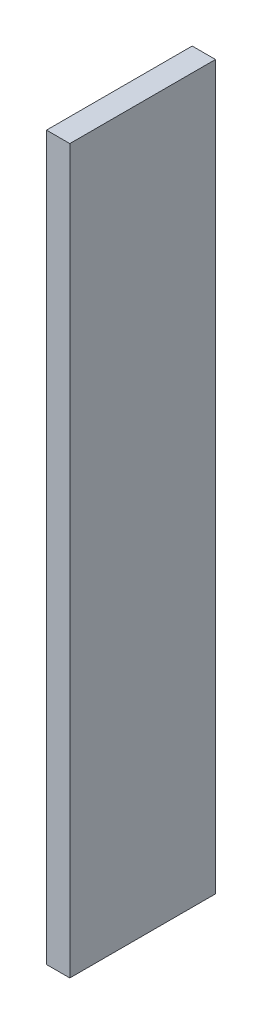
ISO-10303-21;
HEADER;
FILE_DESCRIPTION(('STEP AP214'),'2;1');
FILE_NAME('part.step','',(''),(''),'','','');
FILE_SCHEMA(('AUTOMOTIVE_DESIGN { 1 0 10303 214 1 1 1 1 }'));
ENDSEC;
DATA;
#1=APPLICATION_CONTEXT('core data for automotive mechanical design processes');
#2=APPLICATION_PROTOCOL_DEFINITION('international standard','automotive_design',2000,#1);
#3=PRODUCT_CONTEXT('',#1,'mechanical');
#4=PRODUCT('Part','Part','',(#3));
#5=PRODUCT_RELATED_PRODUCT_CATEGORY('part','',(#4));
#6=PRODUCT_DEFINITION_FORMATION('','',#4);
#7=PRODUCT_DEFINITION_CONTEXT('part definition',#1,'design');
#8=PRODUCT_DEFINITION('design','',#6,#7);
#9=PRODUCT_DEFINITION_SHAPE('','',#8);
#10=(LENGTH_UNIT() NAMED_UNIT(*) SI_UNIT(.MILLI.,.METRE.));
#11=(NAMED_UNIT(*) PLANE_ANGLE_UNIT() SI_UNIT($,.RADIAN.));
#12=(NAMED_UNIT(*) SI_UNIT($,.STERADIAN.) SOLID_ANGLE_UNIT());
#13=UNCERTAINTY_MEASURE_WITH_UNIT(LENGTH_MEASURE(1.E-05),#10,'distance_accuracy_value','');
#14=(GEOMETRIC_REPRESENTATION_CONTEXT(3) GLOBAL_UNCERTAINTY_ASSIGNED_CONTEXT((#13)) GLOBAL_UNIT_ASSIGNED_CONTEXT((#10,
#11,#12)) REPRESENTATION_CONTEXT('',''));
#15=CARTESIAN_POINT('',(0.,0.,0.));
#16=DIRECTION('',(0.,0.,1.));
#17=DIRECTION('',(1.,0.,0.));
#18=AXIS2_PLACEMENT_3D('',#15,#16,#17);
#19=CARTESIAN_POINT('',(0.,62.,25.));
#20=DIRECTION('',(1.,0.,0.));
#21=DIRECTION('',(0.,0.,-1.));
#22=AXIS2_PLACEMENT_3D('',#19,#20,#21);
#23=PLANE('',#22);
#24=DIRECTION('',(0.,0.,-1.));
#25=VECTOR('',#24,1.);
#26=CARTESIAN_POINT('',(1.66533453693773E-13,-62.,0.));
#27=LINE('',#26,#25);
#28=CARTESIAN_POINT('',(3.05311331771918E-13,-62.,25.));
#29=VERTEX_POINT('',#28);
#30=CARTESIAN_POINT('',(1.66533453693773E-13,-62.,0.));
#31=VERTEX_POINT('',#30);
#32=EDGE_CURVE('E11',#29,#31,#27,.T.);
#33=ORIENTED_EDGE('',*,*,#32,.F.);
#34=DIRECTION('',(0.,-1.,0.));
#35=VECTOR('',#34,1.);
#36=CARTESIAN_POINT('',(0.,62.,25.));
#37=LINE('',#36,#35);
#38=CARTESIAN_POINT('',(0.,62.,25.));
#39=VERTEX_POINT('',#38);
#40=EDGE_CURVE('E82',#29,#39,#37,.F.);
#41=ORIENTED_EDGE('',*,*,#40,.T.);
#42=DIRECTION('',(0.,0.,-1.));
#43=VECTOR('',#42,1.);
#44=CARTESIAN_POINT('',(-1.59594559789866E-13,62.,0.));
#45=LINE('',#44,#43);
#46=CARTESIAN_POINT('',(-1.59594559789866E-13,62.,0.));
#47=VERTEX_POINT('',#46);
#48=EDGE_CURVE('E83',#39,#47,#45,.T.);
#49=ORIENTED_EDGE('',*,*,#48,.T.);
#50=DIRECTION('',(0.,1.,0.));
#51=VECTOR('',#50,1.);
#52=CARTESIAN_POINT('',(1.66533453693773E-13,-62.2828427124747,0.));
#53=LINE('',#52,#51);
#54=CARTESIAN_POINT('',(-1.11022302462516E-13,48.,0.));
#55=VERTEX_POINT('',#54);
#56=EDGE_CURVE('E102',#55,#47,#53,.T.);
#57=ORIENTED_EDGE('',*,*,#56,.F.);
#58=DIRECTION('',(0.,0.,-1.));
#59=VECTOR('',#58,1.);
#60=CARTESIAN_POINT('',(0.,48.,25.));
#61=LINE('',#60,#59);
#62=CARTESIAN_POINT('',(0.,48.,6.));
#63=VERTEX_POINT('',#62);
#64=EDGE_CURVE('E107',#63,#55,#61,.T.);
#65=ORIENTED_EDGE('',*,*,#64,.F.);
#66=DIRECTION('',(0.,1.,0.));
#67=VECTOR('',#66,1.);
#68=CARTESIAN_POINT('',(-1.87350135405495E-13,62.,6.));
#69=LINE('',#68,#67);
#70=CARTESIAN_POINT('',(1.38777878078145E-13,-48.,6.));
#71=VERTEX_POINT('',#70);
#72=EDGE_CURVE('E109',#71,#63,#69,.T.);
#73=ORIENTED_EDGE('',*,*,#72,.F.);
#74=DIRECTION('',(0.,0.,-1.));
#75=VECTOR('',#74,1.);
#76=CARTESIAN_POINT('',(2.08166817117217E-13,-48.,25.));
#77=LINE('',#76,#75);
#78=CARTESIAN_POINT('',(1.17961196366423E-13,-48.,0.));
#79=VERTEX_POINT('',#78);
#80=EDGE_CURVE('E112',#79,#71,#77,.F.);
#81=ORIENTED_EDGE('',*,*,#80,.F.);
#82=EDGE_CURVE('E103',#31,#79,#53,.T.);
#83=ORIENTED_EDGE('',*,*,#82,.F.);
#84=EDGE_LOOP('',(#33,#41,#49,#57,#65,#73,#81,#83));
#85=FACE_BOUND('',#84,.T.);
#86=ADVANCED_FACE('F17',(#85),#23,.F.);
#87=CARTESIAN_POINT('',(3.90000000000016,-62.,0.));
#88=DIRECTION('',(0.,1.,0.));
#89=DIRECTION('',(-1.,0.,0.));
#90=AXIS2_PLACEMENT_3D('',#87,#88,#89);
#91=PLANE('',#90);
#92=DIRECTION('',(-1.,0.,0.));
#93=VECTOR('',#92,1.);
#94=CARTESIAN_POINT('',(3.9000000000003,-62.,25.));
#95=LINE('',#94,#93);
#96=CARTESIAN_POINT('',(4.0000000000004,-62.,25.));
#97=VERTEX_POINT('',#96);
#98=EDGE_CURVE('E30',#97,#29,#95,.T.);
#99=ORIENTED_EDGE('',*,*,#98,.T.);
#100=ORIENTED_EDGE('',*,*,#32,.T.);
#101=DIRECTION('',(1.,0.,0.));
#102=VECTOR('',#101,1.);
#103=CARTESIAN_POINT('',(3.90000000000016,-62.,0.));
#104=LINE('',#103,#102);
#105=CARTESIAN_POINT('',(4.00000000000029,-62.,0.));
#106=VERTEX_POINT('',#105);
#107=EDGE_CURVE('E24',#31,#106,#104,.T.);
#108=ORIENTED_EDGE('',*,*,#107,.T.);
#109=DIRECTION('',(0.,0.,-1.));
#110=VECTOR('',#109,1.);
#111=CARTESIAN_POINT('',(4.0000000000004,-62.,25.));
#112=LINE('',#111,#110);
#113=EDGE_CURVE('E86',#97,#106,#112,.T.);
#114=ORIENTED_EDGE('',*,*,#113,.F.);
#115=EDGE_LOOP('',(#99,#100,#108,#114));
#116=FACE_BOUND('',#115,.T.);
#117=ADVANCED_FACE('F87',(#116),#91,.F.);
#118=CARTESIAN_POINT('',(3.89999999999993,62.,25.));
#119=DIRECTION('',(0.,0.,-1.));
#120=DIRECTION('',(-1.,0.,0.));
#121=AXIS2_PLACEMENT_3D('',#118,#119,#120);
#122=PLANE('',#121);
#123=ORIENTED_EDGE('',*,*,#98,.F.);
#124=DIRECTION('',(0.,-1.,0.));
#125=VECTOR('',#124,1.);
#126=CARTESIAN_POINT('',(3.99999999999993,62.,25.));
#127=LINE('',#126,#125);
#128=CARTESIAN_POINT('',(3.99999999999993,62.,25.));
#129=VERTEX_POINT('',#128);
#130=EDGE_CURVE('E80',#129,#97,#127,.T.);
#131=ORIENTED_EDGE('',*,*,#130,.F.);
#132=DIRECTION('',(-1.,0.,0.));
#133=VECTOR('',#132,1.);
#134=CARTESIAN_POINT('',(3.89999999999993,62.,25.));
#135=LINE('',#134,#133);
#136=EDGE_CURVE('E38',#129,#39,#135,.T.);
#137=ORIENTED_EDGE('',*,*,#136,.T.);
#138=ORIENTED_EDGE('',*,*,#40,.F.);
#139=EDGE_LOOP('',(#123,#131,#137,#138));
#140=FACE_BOUND('',#139,.T.);
#141=ADVANCED_FACE('F78',(#140),#122,.F.);
#142=CARTESIAN_POINT('',(3.89999999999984,62.,0.));
#143=DIRECTION('',(0.,1.,0.));
#144=DIRECTION('',(-1.,0.,0.));
#145=AXIS2_PLACEMENT_3D('',#142,#143,#144);
#146=PLANE('',#145);
#147=ORIENTED_EDGE('',*,*,#48,.F.);
#148=ORIENTED_EDGE('',*,*,#136,.F.);
#149=DIRECTION('',(0.,0.,1.));
#150=VECTOR('',#149,1.);
#151=CARTESIAN_POINT('',(3.99999999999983,62.,0.));
#152=LINE('',#151,#150);
#153=CARTESIAN_POINT('',(3.99999999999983,62.,0.));
#154=VERTEX_POINT('',#153);
#155=EDGE_CURVE('E97',#154,#129,#152,.T.);
#156=ORIENTED_EDGE('',*,*,#155,.F.);
#157=DIRECTION('',(1.,0.,0.));
#158=VECTOR('',#157,1.);
#159=CARTESIAN_POINT('',(3.89999999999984,62.,0.));
#160=LINE('',#159,#158);
#161=EDGE_CURVE('E137',#47,#154,#160,.T.);
#162=ORIENTED_EDGE('',*,*,#161,.F.);
#163=EDGE_LOOP('',(#147,#148,#156,#162));
#164=FACE_BOUND('',#163,.T.);
#165=ADVANCED_FACE('F145',(#164),#146,.T.);
#166=CARTESIAN_POINT('',(-6.,0.,12.5));
#167=DIRECTION('',(-1.,0.,0.));
#168=DIRECTION('',(0.,0.,1.));
#169=AXIS2_PLACEMENT_3D('',#166,#167,#168);
#170=PLANE('',#169);
#171=DIRECTION('',(0.,0.,1.));
#172=VECTOR('',#171,1.);
#173=CARTESIAN_POINT('',(-5.99999999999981,-48.,6.));
#174=LINE('',#173,#172);
#175=CARTESIAN_POINT('',(-5.99999999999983,-48.,0.));
#176=VERTEX_POINT('',#175);
#177=CARTESIAN_POINT('',(-5.99999999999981,-48.,6.));
#178=VERTEX_POINT('',#177);
#179=EDGE_CURVE('E129',#176,#178,#174,.T.);
#180=ORIENTED_EDGE('',*,*,#179,.T.);
#181=DIRECTION('',(0.,1.,0.));
#182=VECTOR('',#181,1.);
#183=CARTESIAN_POINT('',(-6.00000000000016,48.,6.));
#184=LINE('',#183,#182);
#185=CARTESIAN_POINT('',(-6.00000000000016,48.,6.));
#186=VERTEX_POINT('',#185);
#187=EDGE_CURVE('E124',#178,#186,#184,.T.);
#188=ORIENTED_EDGE('',*,*,#187,.T.);
#189=DIRECTION('',(0.,0.,-1.));
#190=VECTOR('',#189,1.);
#191=CARTESIAN_POINT('',(-6.00000000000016,48.,6.));
#192=LINE('',#191,#190);
#193=CARTESIAN_POINT('',(-6.00000000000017,48.,0.));
#194=VERTEX_POINT('',#193);
#195=EDGE_CURVE('E118',#186,#194,#192,.T.);
#196=ORIENTED_EDGE('',*,*,#195,.T.);
#197=DIRECTION('',(0.,1.,0.));
#198=VECTOR('',#197,1.);
#199=CARTESIAN_POINT('',(-6.00000000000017,48.,0.));
#200=LINE('',#199,#198);
#201=EDGE_CURVE('E106',#194,#176,#200,.F.);
#202=ORIENTED_EDGE('',*,*,#201,.T.);
#203=EDGE_LOOP('',(#180,#188,#196,#202));
#204=FACE_BOUND('',#203,.T.);
#205=ADVANCED_FACE('F153',(#204),#170,.T.);
#206=CARTESIAN_POINT('',(-6.00000000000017,48.,0.));
#207=DIRECTION('',(0.,0.,1.));
#208=DIRECTION('',(1.,0.,0.));
#209=AXIS2_PLACEMENT_3D('',#206,#207,#208);
#210=PLANE('',#209);
#211=DIRECTION('',(-1.,0.,0.));
#212=VECTOR('',#211,1.);
#213=CARTESIAN_POINT('',(-5.99999999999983,-48.,0.));
#214=LINE('',#213,#212);
#215=EDGE_CURVE('E131',#79,#176,#214,.T.);
#216=ORIENTED_EDGE('',*,*,#215,.T.);
#217=ORIENTED_EDGE('',*,*,#201,.F.);
#218=DIRECTION('',(1.,0.,0.));
#219=VECTOR('',#218,1.);
#220=CARTESIAN_POINT('',(-6.00000000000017,48.,0.));
#221=LINE('',#220,#219);
#222=EDGE_CURVE('E115',#194,#55,#221,.T.);
#223=ORIENTED_EDGE('',*,*,#222,.T.);
#224=ORIENTED_EDGE('',*,*,#56,.T.);
#225=ORIENTED_EDGE('',*,*,#161,.T.);
#226=DIRECTION('',(0.,1.,0.));
#227=VECTOR('',#226,1.);
#228=CARTESIAN_POINT('',(4.00000000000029,-62.,0.));
#229=LINE('',#228,#227);
#230=EDGE_CURVE('E92',#106,#154,#229,.T.);
#231=ORIENTED_EDGE('',*,*,#230,.F.);
#232=ORIENTED_EDGE('',*,*,#107,.F.);
#233=ORIENTED_EDGE('',*,*,#82,.T.);
#234=EDGE_LOOP('',(#216,#217,#223,#224,#225,#231,#232,#233));
#235=FACE_BOUND('',#234,.T.);
#236=ADVANCED_FACE('F147',(#235),#210,.F.);
#237=CARTESIAN_POINT('',(-5.99999999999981,-48.,6.));
#238=DIRECTION('',(0.,1.,0.));
#239=DIRECTION('',(-1.,0.,0.));
#240=AXIS2_PLACEMENT_3D('',#237,#238,#239);
#241=PLANE('',#240);
#242=ORIENTED_EDGE('',*,*,#80,.T.);
#243=DIRECTION('',(-1.,0.,0.));
#244=VECTOR('',#243,1.);
#245=CARTESIAN_POINT('',(-5.99999999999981,-48.,6.));
#246=LINE('',#245,#244);
#247=EDGE_CURVE('E126',#71,#178,#246,.T.);
#248=ORIENTED_EDGE('',*,*,#247,.T.);
#249=ORIENTED_EDGE('',*,*,#179,.F.);
#250=ORIENTED_EDGE('',*,*,#215,.F.);
#251=EDGE_LOOP('',(#242,#248,#249,#250));
#252=FACE_BOUND('',#251,.T.);
#253=ADVANCED_FACE('F160',(#252),#241,.F.);
#254=CARTESIAN_POINT('',(-6.00000000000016,48.,6.));
#255=DIRECTION('',(0.,0.,-1.));
#256=DIRECTION('',(-1.,0.,0.));
#257=AXIS2_PLACEMENT_3D('',#254,#255,#256);
#258=PLANE('',#257);
#259=DIRECTION('',(1.,0.,0.));
#260=VECTOR('',#259,1.);
#261=CARTESIAN_POINT('',(-6.00000000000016,48.,6.));
#262=LINE('',#261,#260);
#263=EDGE_CURVE('E121',#63,#186,#262,.F.);
#264=ORIENTED_EDGE('',*,*,#263,.T.);
#265=ORIENTED_EDGE('',*,*,#187,.F.);
#266=ORIENTED_EDGE('',*,*,#247,.F.);
#267=ORIENTED_EDGE('',*,*,#72,.T.);
#268=EDGE_LOOP('',(#264,#265,#266,#267));
#269=FACE_BOUND('',#268,.T.);
#270=ADVANCED_FACE('F157',(#269),#258,.F.);
#271=CARTESIAN_POINT('',(-6.00000000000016,48.,6.));
#272=DIRECTION('',(0.,-1.,0.));
#273=DIRECTION('',(0.,0.,-1.));
#274=AXIS2_PLACEMENT_3D('',#271,#272,#273);
#275=PLANE('',#274);
#276=ORIENTED_EDGE('',*,*,#64,.T.);
#277=ORIENTED_EDGE('',*,*,#222,.F.);
#278=ORIENTED_EDGE('',*,*,#195,.F.);
#279=ORIENTED_EDGE('',*,*,#263,.F.);
#280=EDGE_LOOP('',(#276,#277,#278,#279));
#281=FACE_BOUND('',#280,.T.);
#282=ADVANCED_FACE('F151',(#281),#275,.F.);
#283=CARTESIAN_POINT('',(4.00000000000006,0.,0.));
#284=DIRECTION('',(1.,0.,0.));
#285=DIRECTION('',(0.,0.,-1.));
#286=AXIS2_PLACEMENT_3D('',#283,#284,#285);
#287=PLANE('',#286);
#288=ORIENTED_EDGE('',*,*,#130,.T.);
#289=ORIENTED_EDGE('',*,*,#113,.T.);
#290=ORIENTED_EDGE('',*,*,#230,.T.);
#291=ORIENTED_EDGE('',*,*,#155,.T.);
#292=EDGE_LOOP('',(#288,#289,#290,#291));
#293=FACE_BOUND('',#292,.T.);
#294=ADVANCED_FACE('F95',(#293),#287,.T.);
#295=CLOSED_SHELL('',(#86,#117,#141,#165,#205,#236,#253,#270,#282,#294));
#296=MANIFOLD_SOLID_BREP('B1',#295);
#297=ADVANCED_BREP_SHAPE_REPRESENTATION('',(#18,#296),#14);
#298=SHAPE_DEFINITION_REPRESENTATION(#9,#297);
ENDSEC;
END-ISO-10303-21;
